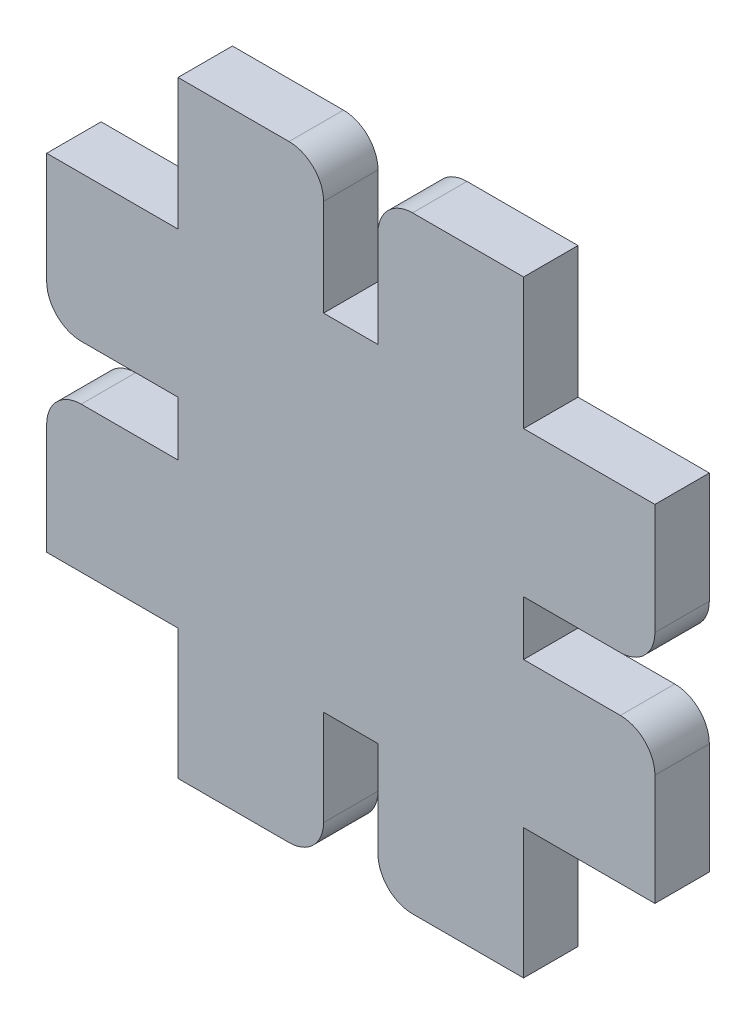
from build123d import *

# Parameters (mm, degrees)
SKETCH1_W           = 25.4
SKETCH1_H           = 25.4
SKETCH1_W_2         = 9.652
SKETCH1_H_2         = 10.700004
SKETCH1_W_3         = 10.700004
SKETCH1_H_3         = 9.570386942
SKETCH1_H_4         = 9.652
BOSS_EXTRUDE1_DEPTH = 3.999992
FILLET1_R           = 2.54
FILLET2_R           = 2.54
FILLET3_R           = 2.54
FILLET4_R           = 2.54
FILLET5_R           = 2.54
FILLET6_R           = 2.54
FILLET7_R           = 2.54
FILLET8_R           = 2.54


with BuildPart() as part:
    # Sketch1 → Boss-Extrude1 (new body)
    with BuildSketch(Plane.XY):
        with Locations((-12.7, 0.970138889)):
            Rectangle(SKETCH1_W, SKETCH1_H)
        with Locations((-30.226, 8.320136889)):
            Rectangle(SKETCH1_W_2, SKETCH1_H_2)
        with Locations((-30.226, -6.379859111)):
            Rectangle(SKETCH1_W_2, SKETCH1_H_2)
        with Locations((-20.049998, -16.515054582)):
            Rectangle(SKETCH1_W_3, SKETCH1_H_3)
        with Locations((-5.350002, -16.515054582)):
            Rectangle(SKETCH1_W_3, SKETCH1_H_3)
        with Locations((4.826, -6.379859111)):
            Rectangle(SKETCH1_W_2, SKETCH1_H_2)
        with Locations((4.826, 8.320136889)):
            Rectangle(SKETCH1_W_2, SKETCH1_H_2)
        with Locations((-5.350002, 18.496138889)):
            Rectangle(SKETCH1_W_3, SKETCH1_H_4)
        with Locations((-20.049998, 18.496138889)):
            Rectangle(SKETCH1_W_3, SKETCH1_H_4)
    extrude(amount=BOSS_EXTRUDE1_DEPTH)

    # Fillet1
    fillet1_edges = [part.edges().sort_by_distance(p)[0] for p in [
        (-35.052, 2.970134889, 1.999996),
    ]]
    fillet(fillet1_edges, radius=FILLET1_R)

    # Fillet2
    fillet2_edges = [part.edges().sort_by_distance(p)[0] for p in [
        (-35.052, -1.029857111, 1.999996),
    ]]
    fillet(fillet2_edges, radius=FILLET2_R)

    # Fillet3
    fillet3_edges = [part.edges().sort_by_distance(p)[0] for p in [
        (-14.699996, 23.322138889, 1.999996),
    ]]
    fillet(fillet3_edges, radius=FILLET3_R)

    # Fillet4
    fillet4_edges = [part.edges().sort_by_distance(p)[0] for p in [
        (-10.700004, 23.322138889, 1.999996),
    ]]
    fillet(fillet4_edges, radius=FILLET4_R)

    # Fillet5
    fillet5_edges = [part.edges().sort_by_distance(p)[0] for p in [
        (9.652, 2.970134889, 1.999996),
    ]]
    fillet(fillet5_edges, radius=FILLET5_R)

    # Fillet6
    fillet6_edges = [part.edges().sort_by_distance(p)[0] for p in [
        (9.652, -1.029857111, 1.999996),
    ]]
    fillet(fillet6_edges, radius=FILLET6_R)

    # Fillet7
    fillet7_edges = [part.edges().sort_by_distance(p)[0] for p in [
        (-10.700004, -21.300248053, 1.999996),
    ]]
    fillet(fillet7_edges, radius=FILLET7_R)

    # Fillet8
    fillet8_edges = [part.edges().sort_by_distance(p)[0] for p in [
        (-14.699996, -21.300248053, 1.999996),
    ]]
    fillet(fillet8_edges, radius=FILLET8_R)


solid = part.part
